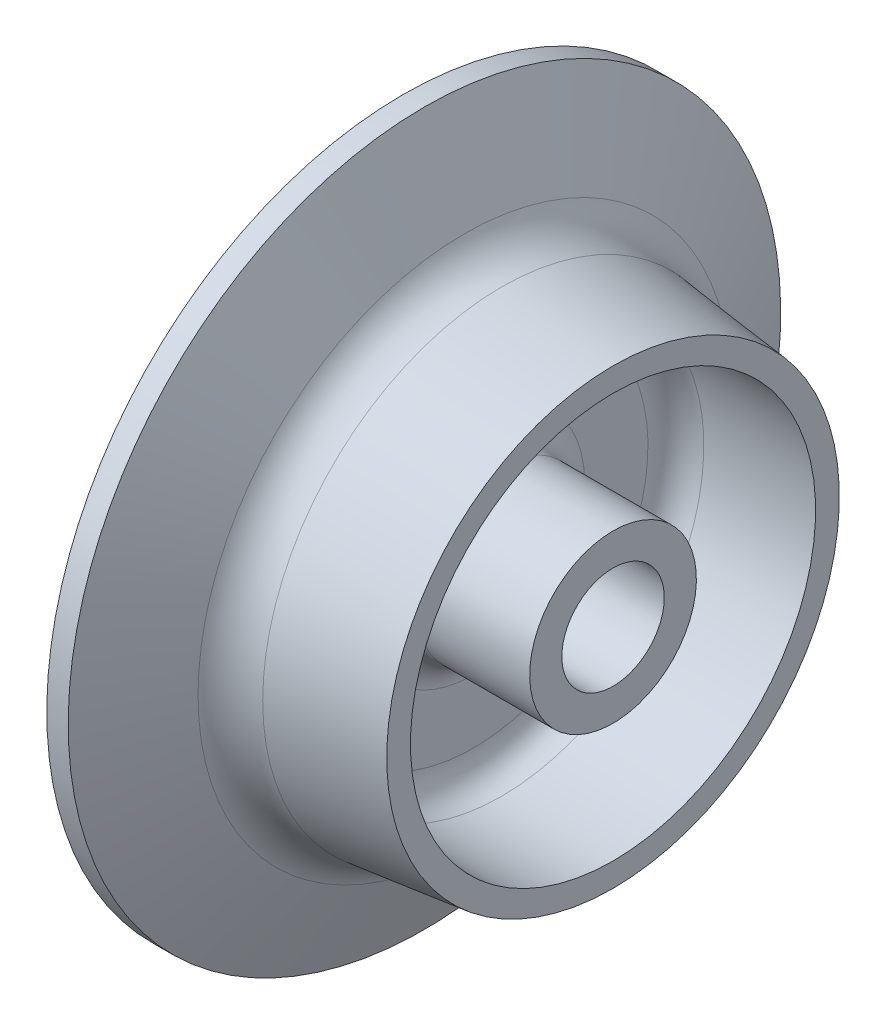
from build123d import *

# Parameters (mm, degrees)
ESQUISSE15_R                 = 3.2
ENL_V_MAT_EXTRU_3_DEPTH      = 59.605695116
ENL_V_MAT_EXTRU_4_DEPTH      = 6
R_P_TITION_CIRCULAIRE1_COUNT = 8
ESQUISSE17_R                 = 5.5
ENL_V_MAT_EXTRU_5_DEPTH      = 12.4


with BuildPart() as part:
    # Esquisse14 → R_volution1 (revolve)
    with BuildSketch(Plane.XY):
        with BuildLine():
            Line((-22.55, 38.25), (-20.25, 38.25))
            Line((-20.25, 38.25), (-15.964617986, 28.596117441))
            ThreePointArc((-15.964617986, 28.596117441), (-14.352446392, 26.593439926), (-11.958253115, 25.656608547))
            Line((-11.958253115, 25.656608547), (0, 24.3))
            Line((0, 24.3), (0, 21.75))
            Line((0, 21.75), (-12, 21.75))
            ThreePointArc((-12, 21.75), (-14.121320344, 20.871320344), (-15, 18.75))
            Line((-15, 18.75), (-15, 11.95))
            ThreePointArc((-15, 11.95), (-14.121320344, 9.828679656), (-12, 8.95))
            Line((-12, 8.95), (0, 8.95))
            Line((0, 8.95), (0, 0))
            Line((0, 0), (-14.65, 0))
            Line((-14.65, 0), (-14.65, 7.5))
            Line((-14.65, 7.5), (-22.05, 29))
            Line((-22.05, 29), (-22.55, 29))
            Line((-22.55, 29), (-22.55, 30.75))
            Line((-22.55, 30.75), (-21.7, 30.75))
            Line((-21.7, 30.75), (-21.7, 36.5))
            Line((-21.7, 36.5), (-22.55, 36.5))
            Line((-22.55, 36.5), (-22.55, 38.25))
        make_face()
    revolve(axis=Axis((14.65, 0, 0), (-1, 0, 0)))

    # Esquisse15 → Enl_v. mat.-Extru.3 (cut, through all)
    with BuildSketch(Plane(origin=(0, 0, 0), x_dir=(0, 0, -1), z_dir=(1, 0, 0))):
        with Locations(Location((0, 0, 0), (0, 0, 90))):
            Circle(ESQUISSE15_R)
    extrude(amount=-ENL_V_MAT_EXTRU_3_DEPTH, mode=Mode.SUBTRACT)

    # Esquisse16 → Enl_v. mat.-Extru.4 (cut)
    with BuildSketch(Plane.ZY.offset(22.55)):
        with BuildLine():
            Line((-5.975216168, 23.65497927), (-2.775216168, 15.860625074))
            ThreePointArc((-2.775216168, 15.860625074), (0, 14), (2.775216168, 15.860625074))
            Line((2.775216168, 15.860625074), (5.975216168, 23.65497927))
            ThreePointArc((5.975216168, 23.65497927), (5.793809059, 26.301720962), (3.584, 27.7696767))
            ThreePointArc((3.584, 27.7696767), (0, 28), (-3.584, 27.7696767))
            ThreePointArc((-3.584, 27.7696767), (-5.793809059, 26.301720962), (-5.975216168, 23.65497927))
        make_face()
    enl_v_mat_extru_4 = extrude(amount=-ENL_V_MAT_EXTRU_4_DEPTH, mode=Mode.SUBTRACT)

    # R_p_tition circulaire1: Enl_v. mat.-Extru.4 ×8 about axis
    r_p_tition_circulaire1_axis = Axis((0, 0, 0), (1, 0, 0))
    for i in range(1, R_P_TITION_CIRCULAIRE1_COUNT):
        add(enl_v_mat_extru_4.rotate(r_p_tition_circulaire1_axis, i * 360 / R_P_TITION_CIRCULAIRE1_COUNT), mode=Mode.SUBTRACT)

    # Esquisse17 → Enl_v. mat.-Extru.5 (cut)
    with BuildSketch(Plane(origin=(0, 0, 0), x_dir=(0, 0, -1), z_dir=(1, 0, 0))):
        with Locations(Location((0, 0, 0), (0, 0, 90))):
            Circle(ESQUISSE17_R)
    extrude(amount=-ENL_V_MAT_EXTRU_5_DEPTH, mode=Mode.SUBTRACT)


solid = part.part
